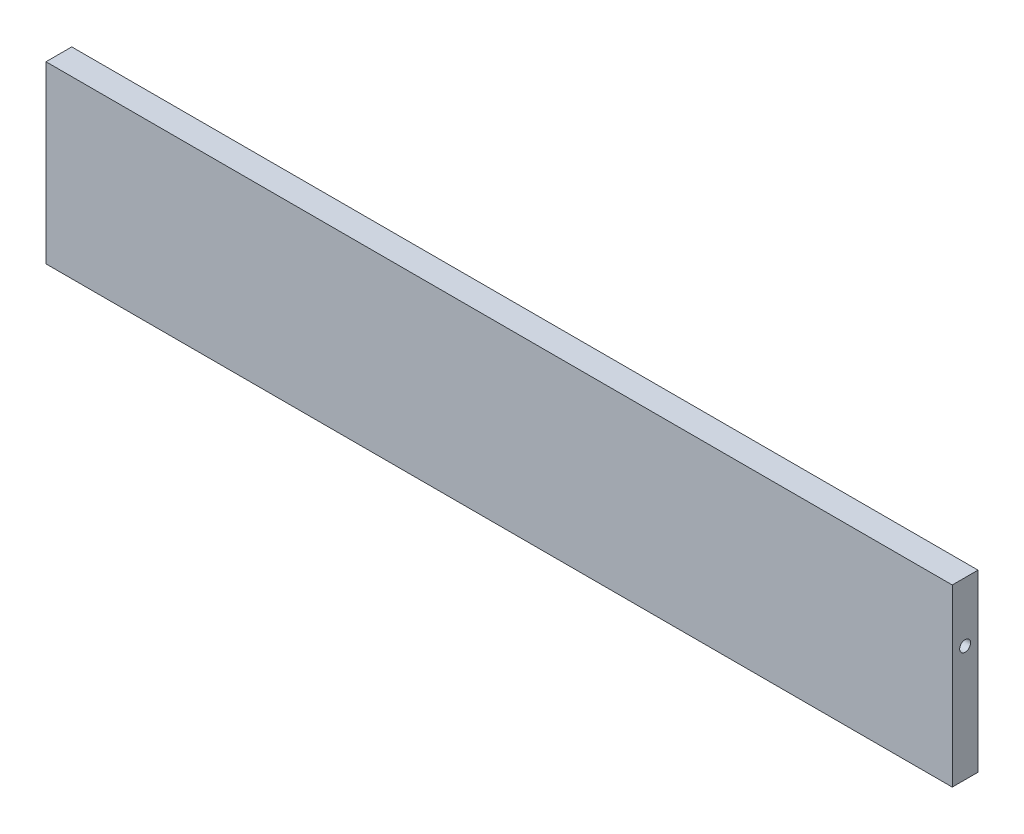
ISO-10303-21;
HEADER;
FILE_DESCRIPTION(('STEP AP214'),'2;1');
FILE_NAME('part.step','',(''),(''),'','','');
FILE_SCHEMA(('AUTOMOTIVE_DESIGN { 1 0 10303 214 1 1 1 1 }'));
ENDSEC;
DATA;
#1=APPLICATION_CONTEXT('core data for automotive mechanical design processes');
#2=APPLICATION_PROTOCOL_DEFINITION('international standard','automotive_design',2000,#1);
#3=PRODUCT_CONTEXT('',#1,'mechanical');
#4=PRODUCT('Part','Part','',(#3));
#5=PRODUCT_RELATED_PRODUCT_CATEGORY('part','',(#4));
#6=PRODUCT_DEFINITION_FORMATION('','',#4);
#7=PRODUCT_DEFINITION_CONTEXT('part definition',#1,'design');
#8=PRODUCT_DEFINITION('design','',#6,#7);
#9=PRODUCT_DEFINITION_SHAPE('','',#8);
#10=(LENGTH_UNIT() NAMED_UNIT(*) SI_UNIT(.MILLI.,.METRE.));
#11=(NAMED_UNIT(*) PLANE_ANGLE_UNIT() SI_UNIT($,.RADIAN.));
#12=(NAMED_UNIT(*) SI_UNIT($,.STERADIAN.) SOLID_ANGLE_UNIT());
#13=UNCERTAINTY_MEASURE_WITH_UNIT(LENGTH_MEASURE(1.E-05),#10,'distance_accuracy_value','');
#14=(GEOMETRIC_REPRESENTATION_CONTEXT(3) GLOBAL_UNCERTAINTY_ASSIGNED_CONTEXT((#13)) GLOBAL_UNIT_ASSIGNED_CONTEXT((#10,
#11,#12)) REPRESENTATION_CONTEXT('',''));
#15=CARTESIAN_POINT('',(0.,0.,0.));
#16=DIRECTION('',(0.,0.,1.));
#17=DIRECTION('',(1.,0.,0.));
#18=AXIS2_PLACEMENT_3D('',#15,#16,#17);
#19=CARTESIAN_POINT('',(-111.76,21.59,6.35));
#20=DIRECTION('',(1.,0.,0.));
#21=DIRECTION('',(0.,1.,0.));
#22=AXIS2_PLACEMENT_3D('',#19,#20,#21);
#23=PLANE('',#22);
#24=CARTESIAN_POINT('',(-111.76,6.98499999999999,3.175));
#25=DIRECTION('',(-1.,0.,0.));
#26=DIRECTION('',(0.,0.,1.));
#27=AXIS2_PLACEMENT_3D('',#24,#25,#26);
#28=CIRCLE('',#27,1.35254999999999);
#29=CARTESIAN_POINT('',(-111.76,6.98499999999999,4.52754999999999));
#30=VERTEX_POINT('',#29);
#31=EDGE_CURVE('E106',#30,#30,#28,.T.);
#32=ORIENTED_EDGE('',*,*,#31,.F.);
#33=EDGE_LOOP('',(#32));
#34=FACE_BOUND('',#33,.T.);
#35=DIRECTION('',(0.,-1.,0.));
#36=VECTOR('',#35,1.);
#37=CARTESIAN_POINT('',(-111.76,21.59,0.));
#38=LINE('',#37,#36);
#39=CARTESIAN_POINT('',(-111.76,21.59,0.));
#40=VERTEX_POINT('',#39);
#41=CARTESIAN_POINT('',(-111.76,-21.59,0.));
#42=VERTEX_POINT('',#41);
#43=EDGE_CURVE('E123',#40,#42,#38,.T.);
#44=ORIENTED_EDGE('',*,*,#43,.T.);
#45=DIRECTION('',(0.,0.,-1.));
#46=VECTOR('',#45,1.);
#47=CARTESIAN_POINT('',(-111.76,-21.59,6.35));
#48=LINE('',#47,#46);
#49=CARTESIAN_POINT('',(-111.76,-21.59,6.35));
#50=VERTEX_POINT('',#49);
#51=EDGE_CURVE('E11',#50,#42,#48,.T.);
#52=ORIENTED_EDGE('',*,*,#51,.F.);
#53=DIRECTION('',(0.,-1.,0.));
#54=VECTOR('',#53,1.);
#55=CARTESIAN_POINT('',(-111.76,21.59,6.35));
#56=LINE('',#55,#54);
#57=CARTESIAN_POINT('',(-111.76,21.59,6.35));
#58=VERTEX_POINT('',#57);
#59=EDGE_CURVE('E124',#58,#50,#56,.T.);
#60=ORIENTED_EDGE('',*,*,#59,.F.);
#61=DIRECTION('',(0.,0.,-1.));
#62=VECTOR('',#61,1.);
#63=CARTESIAN_POINT('',(-111.76,21.59,6.35));
#64=LINE('',#63,#62);
#65=EDGE_CURVE('E130',#58,#40,#64,.T.);
#66=ORIENTED_EDGE('',*,*,#65,.T.);
#67=EDGE_LOOP('',(#44,#52,#60,#66));
#68=FACE_BOUND('',#67,.T.);
#69=ADVANCED_FACE('F39',(#34,#68),#23,.F.);
#70=CARTESIAN_POINT('',(-111.76,-21.59,6.35));
#71=DIRECTION('',(0.,1.,0.));
#72=DIRECTION('',(0.,0.,1.));
#73=AXIS2_PLACEMENT_3D('',#70,#71,#72);
#74=PLANE('',#73);
#75=CARTESIAN_POINT('',(0.,-21.59,3.17499999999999));
#76=DIRECTION('',(0.,-1.,0.));
#77=DIRECTION('',(0.,0.,-1.));
#78=AXIS2_PLACEMENT_3D('',#75,#76,#77);
#79=CIRCLE('',#78,1.35254999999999);
#80=CARTESIAN_POINT('',(0.,-21.59,1.82245));
#81=VERTEX_POINT('',#80);
#82=EDGE_CURVE('E107',#81,#81,#79,.T.);
#83=ORIENTED_EDGE('',*,*,#82,.F.);
#84=EDGE_LOOP('',(#83));
#85=FACE_BOUND('',#84,.T.);
#86=DIRECTION('',(1.,0.,0.));
#87=VECTOR('',#86,1.);
#88=CARTESIAN_POINT('',(-111.76,-21.59,0.));
#89=LINE('',#88,#87);
#90=CARTESIAN_POINT('',(111.76,-21.59,0.));
#91=VERTEX_POINT('',#90);
#92=EDGE_CURVE('E133',#42,#91,#89,.T.);
#93=ORIENTED_EDGE('',*,*,#92,.T.);
#94=DIRECTION('',(0.,0.,-1.));
#95=VECTOR('',#94,1.);
#96=CARTESIAN_POINT('',(111.76,-21.59,6.35));
#97=LINE('',#96,#95);
#98=CARTESIAN_POINT('',(111.76,-21.59,6.35));
#99=VERTEX_POINT('',#98);
#100=EDGE_CURVE('E47',#99,#91,#97,.T.);
#101=ORIENTED_EDGE('',*,*,#100,.F.);
#102=DIRECTION('',(1.,0.,0.));
#103=VECTOR('',#102,1.);
#104=CARTESIAN_POINT('',(-111.76,-21.59,6.35));
#105=LINE('',#104,#103);
#106=EDGE_CURVE('E86',#50,#99,#105,.T.);
#107=ORIENTED_EDGE('',*,*,#106,.F.);
#108=ORIENTED_EDGE('',*,*,#51,.T.);
#109=EDGE_LOOP('',(#93,#101,#107,#108));
#110=FACE_BOUND('',#109,.T.);
#111=ADVANCED_FACE('F157',(#85,#110),#74,.F.);
#112=CARTESIAN_POINT('',(111.76,21.59,6.35));
#113=DIRECTION('',(-1.,0.,0.));
#114=DIRECTION('',(0.,-1.,0.));
#115=AXIS2_PLACEMENT_3D('',#112,#113,#114);
#116=PLANE('',#115);
#117=CARTESIAN_POINT('',(111.76,6.98499999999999,3.175));
#118=DIRECTION('',(1.,0.,0.));
#119=DIRECTION('',(0.,0.,-1.));
#120=AXIS2_PLACEMENT_3D('',#117,#118,#119);
#121=CIRCLE('',#120,1.35254999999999);
#122=CARTESIAN_POINT('',(111.76,6.98499999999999,1.82245000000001));
#123=VERTEX_POINT('',#122);
#124=EDGE_CURVE('E117',#123,#123,#121,.T.);
#125=ORIENTED_EDGE('',*,*,#124,.F.);
#126=EDGE_LOOP('',(#125));
#127=FACE_BOUND('',#126,.T.);
#128=DIRECTION('',(0.,1.,0.));
#129=VECTOR('',#128,1.);
#130=CARTESIAN_POINT('',(111.76,21.59,0.));
#131=LINE('',#130,#129);
#132=CARTESIAN_POINT('',(111.76,21.59,0.));
#133=VERTEX_POINT('',#132);
#134=EDGE_CURVE('E73',#91,#133,#131,.T.);
#135=ORIENTED_EDGE('',*,*,#134,.T.);
#136=DIRECTION('',(0.,0.,-1.));
#137=VECTOR('',#136,1.);
#138=CARTESIAN_POINT('',(111.76,21.59,6.35));
#139=LINE('',#138,#137);
#140=CARTESIAN_POINT('',(111.76,21.59,6.35));
#141=VERTEX_POINT('',#140);
#142=EDGE_CURVE('E138',#141,#133,#139,.T.);
#143=ORIENTED_EDGE('',*,*,#142,.F.);
#144=DIRECTION('',(0.,1.,0.));
#145=VECTOR('',#144,1.);
#146=CARTESIAN_POINT('',(111.76,21.59,6.35));
#147=LINE('',#146,#145);
#148=EDGE_CURVE('E127',#99,#141,#147,.T.);
#149=ORIENTED_EDGE('',*,*,#148,.F.);
#150=ORIENTED_EDGE('',*,*,#100,.T.);
#151=EDGE_LOOP('',(#135,#143,#149,#150));
#152=FACE_BOUND('',#151,.T.);
#153=ADVANCED_FACE('F140',(#127,#152),#116,.F.);
#154=CARTESIAN_POINT('',(-111.76,21.59,6.35));
#155=DIRECTION('',(0.,-1.,0.));
#156=DIRECTION('',(0.,0.,-1.));
#157=AXIS2_PLACEMENT_3D('',#154,#155,#156);
#158=PLANE('',#157);
#159=DIRECTION('',(-1.,0.,0.));
#160=VECTOR('',#159,1.);
#161=CARTESIAN_POINT('',(-111.76,21.59,0.));
#162=LINE('',#161,#160);
#163=EDGE_CURVE('E79',#133,#40,#162,.T.);
#164=ORIENTED_EDGE('',*,*,#163,.T.);
#165=ORIENTED_EDGE('',*,*,#65,.F.);
#166=DIRECTION('',(-1.,0.,0.));
#167=VECTOR('',#166,1.);
#168=CARTESIAN_POINT('',(-111.76,21.59,6.35));
#169=LINE('',#168,#167);
#170=EDGE_CURVE('E55',#141,#58,#169,.T.);
#171=ORIENTED_EDGE('',*,*,#170,.F.);
#172=ORIENTED_EDGE('',*,*,#142,.T.);
#173=EDGE_LOOP('',(#164,#165,#171,#172));
#174=FACE_BOUND('',#173,.T.);
#175=ADVANCED_FACE('F147',(#174),#158,.F.);
#176=CARTESIAN_POINT('',(0.,0.,6.35));
#177=DIRECTION('',(0.,0.,1.));
#178=DIRECTION('',(1.,0.,0.));
#179=AXIS2_PLACEMENT_3D('',#176,#177,#178);
#180=PLANE('',#179);
#181=ORIENTED_EDGE('',*,*,#59,.T.);
#182=ORIENTED_EDGE('',*,*,#106,.T.);
#183=ORIENTED_EDGE('',*,*,#148,.T.);
#184=ORIENTED_EDGE('',*,*,#170,.T.);
#185=EDGE_LOOP('',(#181,#182,#183,#184));
#186=FACE_BOUND('',#185,.T.);
#187=ADVANCED_FACE('F149',(#186),#180,.T.);
#188=CARTESIAN_POINT('',(0.,0.,0.));
#189=DIRECTION('',(0.,0.,1.));
#190=DIRECTION('',(1.,0.,0.));
#191=AXIS2_PLACEMENT_3D('',#188,#189,#190);
#192=PLANE('',#191);
#193=ORIENTED_EDGE('',*,*,#43,.F.);
#194=ORIENTED_EDGE('',*,*,#163,.F.);
#195=ORIENTED_EDGE('',*,*,#134,.F.);
#196=ORIENTED_EDGE('',*,*,#92,.F.);
#197=EDGE_LOOP('',(#193,#194,#195,#196));
#198=FACE_BOUND('',#197,.T.);
#199=ADVANCED_FACE('F143',(#198),#192,.F.);
#200=CARTESIAN_POINT('',(102.362,6.98499999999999,3.175));
#201=DIRECTION('',(1.,0.,0.));
#202=DIRECTION('',(0.,0.,-1.));
#203=AXIS2_PLACEMENT_3D('',#200,#201,#202);
#204=CONICAL_SURFACE('',#203,1.35255,1.02974425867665);
#205=CARTESIAN_POINT('',(101.549305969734,6.98499999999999,3.175));
#206=VERTEX_POINT('',#205);
#207=VERTEX_LOOP('',#206);
#208=FACE_BOUND('',#207,.T.);
#209=CARTESIAN_POINT('',(102.362,6.98499999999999,3.175));
#210=DIRECTION('',(1.,0.,0.));
#211=DIRECTION('',(0.,0.,-1.));
#212=AXIS2_PLACEMENT_3D('',#209,#210,#211);
#213=CIRCLE('',#212,1.35255);
#214=CARTESIAN_POINT('',(102.362,6.98499999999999,1.82245));
#215=VERTEX_POINT('',#214);
#216=EDGE_CURVE('E120',#215,#215,#213,.T.);
#217=ORIENTED_EDGE('',*,*,#216,.T.);
#218=EDGE_LOOP('',(#217));
#219=FACE_BOUND('',#218,.T.);
#220=ADVANCED_FACE('F186',(#208,#219),#204,.F.);
#221=CARTESIAN_POINT('',(111.76,6.98499999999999,3.175));
#222=DIRECTION('',(1.,0.,0.));
#223=DIRECTION('',(0.,0.,-1.));
#224=AXIS2_PLACEMENT_3D('',#221,#222,#223);
#225=CYLINDRICAL_SURFACE('',#224,1.35254999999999);
#226=ORIENTED_EDGE('',*,*,#216,.F.);
#227=EDGE_LOOP('',(#226));
#228=FACE_BOUND('',#227,.T.);
#229=ORIENTED_EDGE('',*,*,#124,.T.);
#230=EDGE_LOOP('',(#229));
#231=FACE_BOUND('',#230,.T.);
#232=ADVANCED_FACE('F178',(#228,#231),#225,.F.);
#233=CARTESIAN_POINT('',(-102.362,6.98499999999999,3.175));
#234=DIRECTION('',(-1.,0.,0.));
#235=DIRECTION('',(0.,0.,1.));
#236=AXIS2_PLACEMENT_3D('',#233,#234,#235);
#237=CONICAL_SURFACE('',#236,1.35255,1.02974425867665);
#238=CARTESIAN_POINT('',(-101.549305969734,6.98499999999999,3.175));
#239=VERTEX_POINT('',#238);
#240=VERTEX_LOOP('',#239);
#241=FACE_BOUND('',#240,.T.);
#242=CARTESIAN_POINT('',(-102.362,6.98499999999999,3.175));
#243=DIRECTION('',(-1.,0.,0.));
#244=DIRECTION('',(0.,0.,1.));
#245=AXIS2_PLACEMENT_3D('',#242,#243,#244);
#246=CIRCLE('',#245,1.35255);
#247=CARTESIAN_POINT('',(-102.362,6.98499999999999,4.52755));
#248=VERTEX_POINT('',#247);
#249=EDGE_CURVE('E110',#248,#248,#246,.T.);
#250=ORIENTED_EDGE('',*,*,#249,.T.);
#251=EDGE_LOOP('',(#250));
#252=FACE_BOUND('',#251,.T.);
#253=ADVANCED_FACE('F172',(#241,#252),#237,.F.);
#254=CARTESIAN_POINT('',(-111.76,6.98499999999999,3.175));
#255=DIRECTION('',(-1.,0.,0.));
#256=DIRECTION('',(0.,0.,1.));
#257=AXIS2_PLACEMENT_3D('',#254,#255,#256);
#258=CYLINDRICAL_SURFACE('',#257,1.35254999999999);
#259=ORIENTED_EDGE('',*,*,#249,.F.);
#260=EDGE_LOOP('',(#259));
#261=FACE_BOUND('',#260,.T.);
#262=ORIENTED_EDGE('',*,*,#31,.T.);
#263=EDGE_LOOP('',(#262));
#264=FACE_BOUND('',#263,.T.);
#265=ADVANCED_FACE('F100',(#261,#264),#258,.F.);
#266=CARTESIAN_POINT('',(0.,-12.192,3.17499999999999));
#267=DIRECTION('',(0.,-1.,0.));
#268=DIRECTION('',(0.,0.,-1.));
#269=AXIS2_PLACEMENT_3D('',#266,#267,#268);
#270=CONICAL_SURFACE('',#269,1.35254999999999,1.02974425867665);
#271=CARTESIAN_POINT('',(0.,-11.3793059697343,3.17499999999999));
#272=VERTEX_POINT('',#271);
#273=VERTEX_LOOP('',#272);
#274=FACE_BOUND('',#273,.T.);
#275=CARTESIAN_POINT('',(0.,-12.192,3.17499999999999));
#276=DIRECTION('',(0.,-1.,0.));
#277=DIRECTION('',(0.,0.,-1.));
#278=AXIS2_PLACEMENT_3D('',#275,#276,#277);
#279=CIRCLE('',#278,1.35254999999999);
#280=CARTESIAN_POINT('',(0.,-12.192,1.82245));
#281=VERTEX_POINT('',#280);
#282=EDGE_CURVE('E104',#281,#281,#279,.T.);
#283=ORIENTED_EDGE('',*,*,#282,.T.);
#284=EDGE_LOOP('',(#283));
#285=FACE_BOUND('',#284,.T.);
#286=ADVANCED_FACE('F96',(#274,#285),#270,.F.);
#287=CARTESIAN_POINT('',(0.,-21.59,3.17499999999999));
#288=DIRECTION('',(0.,-1.,0.));
#289=DIRECTION('',(0.,0.,-1.));
#290=AXIS2_PLACEMENT_3D('',#287,#288,#289);
#291=CYLINDRICAL_SURFACE('',#290,1.35254999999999);
#292=ORIENTED_EDGE('',*,*,#282,.F.);
#293=EDGE_LOOP('',(#292));
#294=FACE_BOUND('',#293,.T.);
#295=ORIENTED_EDGE('',*,*,#82,.T.);
#296=EDGE_LOOP('',(#295));
#297=FACE_BOUND('',#296,.T.);
#298=ADVANCED_FACE('F99',(#294,#297),#291,.F.);
#299=CLOSED_SHELL('',(#69,#111,#153,#175,#187,#199,#220,#232,#253,#265,#286,#298));
#300=MANIFOLD_SOLID_BREP('B2',#299);
#301=ADVANCED_BREP_SHAPE_REPRESENTATION('',(#18,#300),#14);
#302=SHAPE_DEFINITION_REPRESENTATION(#9,#301);
ENDSEC;
END-ISO-10303-21;
